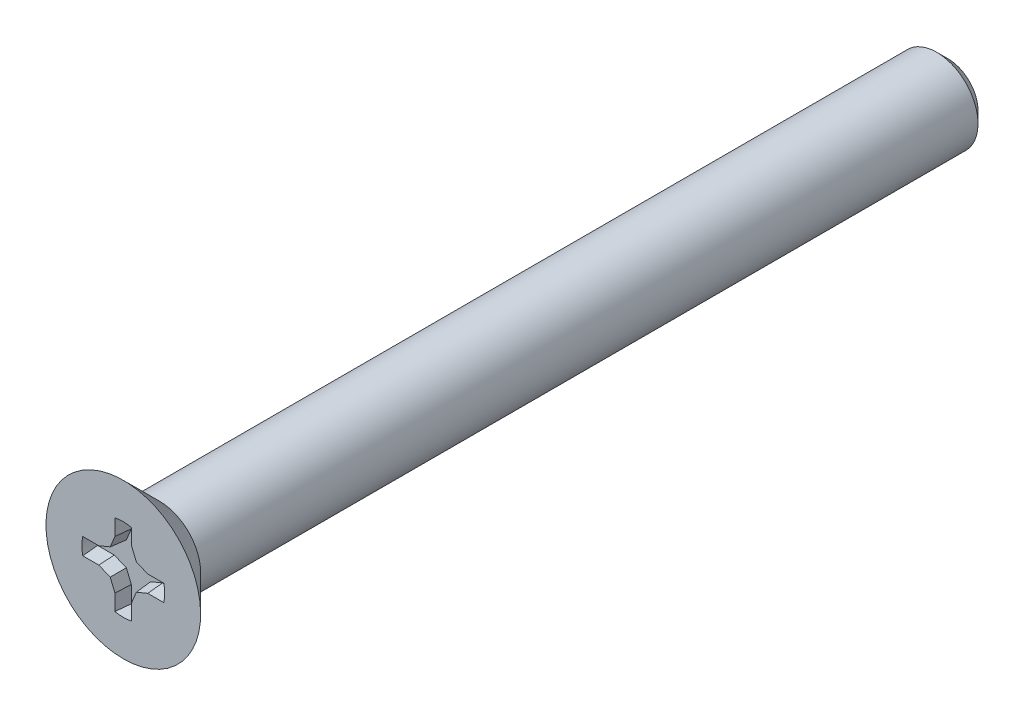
ISO-10303-21;
HEADER;
FILE_DESCRIPTION(('STEP AP214'),'2;1');
FILE_NAME('part.step','',(''),(''),'','','');
FILE_SCHEMA(('AUTOMOTIVE_DESIGN { 1 0 10303 214 1 1 1 1 }'));
ENDSEC;
DATA;
#1=APPLICATION_CONTEXT('core data for automotive mechanical design processes');
#2=APPLICATION_PROTOCOL_DEFINITION('international standard','automotive_design',2000,#1);
#3=PRODUCT_CONTEXT('',#1,'mechanical');
#4=PRODUCT('Part','Part','',(#3));
#5=PRODUCT_RELATED_PRODUCT_CATEGORY('part','',(#4));
#6=PRODUCT_DEFINITION_FORMATION('','',#4);
#7=PRODUCT_DEFINITION_CONTEXT('part definition',#1,'design');
#8=PRODUCT_DEFINITION('design','',#6,#7);
#9=PRODUCT_DEFINITION_SHAPE('','',#8);
#10=(LENGTH_UNIT() NAMED_UNIT(*) SI_UNIT(.MILLI.,.METRE.));
#11=(NAMED_UNIT(*) PLANE_ANGLE_UNIT() SI_UNIT($,.RADIAN.));
#12=(NAMED_UNIT(*) SI_UNIT($,.STERADIAN.) SOLID_ANGLE_UNIT());
#13=UNCERTAINTY_MEASURE_WITH_UNIT(LENGTH_MEASURE(1.E-05),#10,'distance_accuracy_value','');
#14=(GEOMETRIC_REPRESENTATION_CONTEXT(3) GLOBAL_UNCERTAINTY_ASSIGNED_CONTEXT((#13)) GLOBAL_UNIT_ASSIGNED_CONTEXT((#10,
#11,#12)) REPRESENTATION_CONTEXT('',''));
#15=CARTESIAN_POINT('',(0.,0.,0.));
#16=DIRECTION('',(0.,0.,1.));
#17=DIRECTION('',(1.,0.,0.));
#18=AXIS2_PLACEMENT_3D('',#15,#16,#17);
#19=CARTESIAN_POINT('',(0.,0.,2.2));
#20=DIRECTION('',(0.,0.,-1.));
#21=DIRECTION('',(0.,1.,0.));
#22=AXIS2_PLACEMENT_3D('',#19,#20,#21);
#23=PLANE('',#22);
#24=CARTESIAN_POINT('',(0.,0.,2.2));
#25=DIRECTION('',(0.,0.,1.));
#26=DIRECTION('',(0.,-1.,0.));
#27=AXIS2_PLACEMENT_3D('',#24,#25,#26);
#28=CIRCLE('',#27,3.75);
#29=CARTESIAN_POINT('',(0.,-3.75,2.2));
#30=VERTEX_POINT('',#29);
#31=EDGE_CURVE('E11',#30,#30,#28,.T.);
#32=ORIENTED_EDGE('',*,*,#31,.T.);
#33=EDGE_LOOP('',(#32));
#34=FACE_BOUND('',#33,.T.);
#35=CARTESIAN_POINT('',(0.,0.,2.2));
#36=DIRECTION('',(0.,0.,1.));
#37=DIRECTION('',(1.,0.,0.));
#38=AXIS2_PLACEMENT_3D('',#35,#36,#37);
#39=CIRCLE('',#38,2.0066);
#40=CARTESIAN_POINT('',(1.96501465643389,-0.406400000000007,2.2));
#41=VERTEX_POINT('',#40);
#42=CARTESIAN_POINT('',(1.96501465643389,0.4064,2.2));
#43=VERTEX_POINT('',#42);
#44=EDGE_CURVE('E253',#41,#43,#39,.T.);
#45=ORIENTED_EDGE('',*,*,#44,.F.);
#46=DIRECTION('',(-1.,0.,0.));
#47=VECTOR('',#46,1.);
#48=CARTESIAN_POINT('',(0.,-0.4064,2.2));
#49=LINE('',#48,#47);
#50=CARTESIAN_POINT('',(1.18570732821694,-0.406400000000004,2.2));
#51=VERTEX_POINT('',#50);
#52=EDGE_CURVE('E244',#41,#51,#49,.T.);
#53=ORIENTED_EDGE('',*,*,#52,.T.);
#54=DIRECTION('',(-0.923879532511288,-0.382683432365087,0.));
#55=VECTOR('',#54,1.);
#56=CARTESIAN_POINT('',(0.317326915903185,-0.766094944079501,2.2));
#57=LINE('',#56,#55);
#58=CARTESIAN_POINT('',(0.634653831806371,-0.634653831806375,2.2));
#59=VERTEX_POINT('',#58);
#60=EDGE_CURVE('E240',#51,#59,#57,.T.);
#61=ORIENTED_EDGE('',*,*,#60,.T.);
#62=DIRECTION('',(-0.382683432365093,-0.923879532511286,0.));
#63=VECTOR('',#62,1.);
#64=CARTESIAN_POINT('',(0.766094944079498,-0.317326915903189,2.2));
#65=LINE('',#64,#63);
#66=CARTESIAN_POINT('',(0.406399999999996,-1.18570732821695,2.2));
#67=VERTEX_POINT('',#66);
#68=EDGE_CURVE('E236',#59,#67,#65,.T.);
#69=ORIENTED_EDGE('',*,*,#68,.T.);
#70=DIRECTION('',(0.,1.,0.));
#71=VECTOR('',#70,1.);
#72=CARTESIAN_POINT('',(0.4064,0.,2.2));
#73=LINE('',#72,#71);
#74=CARTESIAN_POINT('',(0.406399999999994,-1.96501465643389,2.2));
#75=VERTEX_POINT('',#74);
#76=EDGE_CURVE('E232',#75,#67,#73,.T.);
#77=ORIENTED_EDGE('',*,*,#76,.F.);
#78=CARTESIAN_POINT('',(0.,0.,2.2));
#79=DIRECTION('',(0.,0.,1.));
#80=DIRECTION('',(0.,-1.,0.));
#81=AXIS2_PLACEMENT_3D('',#78,#79,#80);
#82=CIRCLE('',#81,2.0066);
#83=CARTESIAN_POINT('',(-0.4064,-1.96501465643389,2.2));
#84=VERTEX_POINT('',#83);
#85=EDGE_CURVE('E227',#84,#75,#82,.T.);
#86=ORIENTED_EDGE('',*,*,#85,.F.);
#87=DIRECTION('',(0.,1.,0.));
#88=VECTOR('',#87,1.);
#89=CARTESIAN_POINT('',(-0.4064,0.,2.2));
#90=LINE('',#89,#88);
#91=CARTESIAN_POINT('',(-0.4064,-1.18570732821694,2.2));
#92=VERTEX_POINT('',#91);
#93=EDGE_CURVE('E223',#84,#92,#90,.T.);
#94=ORIENTED_EDGE('',*,*,#93,.T.);
#95=DIRECTION('',(-0.382683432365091,0.923879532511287,0.));
#96=VECTOR('',#95,1.);
#97=CARTESIAN_POINT('',(-0.766094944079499,-0.317326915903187,2.2));
#98=LINE('',#97,#96);
#99=CARTESIAN_POINT('',(-0.634653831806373,-0.634653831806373,2.2));
#100=VERTEX_POINT('',#99);
#101=EDGE_CURVE('E219',#92,#100,#98,.T.);
#102=ORIENTED_EDGE('',*,*,#101,.T.);
#103=DIRECTION('',(-0.923879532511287,0.38268343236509,0.));
#104=VECTOR('',#103,1.);
#105=CARTESIAN_POINT('',(-0.317326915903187,-0.766094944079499,2.2));
#106=LINE('',#105,#104);
#107=CARTESIAN_POINT('',(-1.18570732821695,-0.4064,2.2));
#108=VERTEX_POINT('',#107);
#109=EDGE_CURVE('E215',#100,#108,#106,.T.);
#110=ORIENTED_EDGE('',*,*,#109,.T.);
#111=DIRECTION('',(1.,0.,0.));
#112=VECTOR('',#111,1.);
#113=CARTESIAN_POINT('',(0.,-0.4064,2.2));
#114=LINE('',#113,#112);
#115=CARTESIAN_POINT('',(-1.96501465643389,-0.4064,2.2));
#116=VERTEX_POINT('',#115);
#117=EDGE_CURVE('E211',#116,#108,#114,.T.);
#118=ORIENTED_EDGE('',*,*,#117,.F.);
#119=CARTESIAN_POINT('',(0.,0.,2.2));
#120=DIRECTION('',(0.,0.,1.));
#121=DIRECTION('',(-1.,0.,0.));
#122=AXIS2_PLACEMENT_3D('',#119,#120,#121);
#123=CIRCLE('',#122,2.0066);
#124=CARTESIAN_POINT('',(-1.96501465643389,0.40640000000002,2.2));
#125=VERTEX_POINT('',#124);
#126=EDGE_CURVE('E206',#125,#116,#123,.T.);
#127=ORIENTED_EDGE('',*,*,#126,.F.);
#128=DIRECTION('',(1.,0.,0.));
#129=VECTOR('',#128,1.);
#130=CARTESIAN_POINT('',(0.,0.4064,2.2));
#131=LINE('',#130,#129);
#132=CARTESIAN_POINT('',(-1.18570732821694,0.406400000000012,2.2));
#133=VERTEX_POINT('',#132);
#134=EDGE_CURVE('E202',#125,#133,#131,.T.);
#135=ORIENTED_EDGE('',*,*,#134,.T.);
#136=DIRECTION('',(0.923879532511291,0.382683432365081,0.));
#137=VECTOR('',#136,1.);
#138=CARTESIAN_POINT('',(-0.317326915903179,0.766094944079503,2.2));
#139=LINE('',#138,#137);
#140=CARTESIAN_POINT('',(-0.634653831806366,0.63465383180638,2.2));
#141=VERTEX_POINT('',#140);
#142=EDGE_CURVE('E199',#133,#141,#139,.T.);
#143=ORIENTED_EDGE('',*,*,#142,.T.);
#144=DIRECTION('',(0.3826834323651,0.923879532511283,0.));
#145=VECTOR('',#144,1.);
#146=CARTESIAN_POINT('',(-0.766094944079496,0.317326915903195,2.2));
#147=LINE('',#146,#145);
#148=CARTESIAN_POINT('',(-0.406399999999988,1.18570732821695,2.2));
#149=VERTEX_POINT('',#148);
#150=EDGE_CURVE('E192',#141,#149,#147,.T.);
#151=ORIENTED_EDGE('',*,*,#150,.T.);
#152=DIRECTION('',(0.,-1.,0.));
#153=VECTOR('',#152,1.);
#154=CARTESIAN_POINT('',(-0.4064,0.,2.2));
#155=LINE('',#154,#153);
#156=CARTESIAN_POINT('',(-0.40639999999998,1.96501465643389,2.2));
#157=VERTEX_POINT('',#156);
#158=EDGE_CURVE('E185',#157,#149,#155,.T.);
#159=ORIENTED_EDGE('',*,*,#158,.F.);
#160=CARTESIAN_POINT('',(0.,0.,2.2));
#161=DIRECTION('',(0.,0.,1.));
#162=DIRECTION('',(1.,0.,0.));
#163=AXIS2_PLACEMENT_3D('',#160,#161,#162);
#164=CIRCLE('',#163,2.0066);
#165=CARTESIAN_POINT('',(0.4064,1.96501465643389,2.2));
#166=VERTEX_POINT('',#165);
#167=EDGE_CURVE('E170',#157,#166,#164,.F.);
#168=ORIENTED_EDGE('',*,*,#167,.T.);
#169=DIRECTION('',(0.,-1.,0.));
#170=VECTOR('',#169,1.);
#171=CARTESIAN_POINT('',(0.4064,0.,2.2));
#172=LINE('',#171,#170);
#173=CARTESIAN_POINT('',(0.4064,1.18570732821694,2.2));
#174=VERTEX_POINT('',#173);
#175=EDGE_CURVE('E179',#166,#174,#172,.T.);
#176=ORIENTED_EDGE('',*,*,#175,.T.);
#177=DIRECTION('',(0.382683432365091,-0.923879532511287,0.));
#178=VECTOR('',#177,1.);
#179=CARTESIAN_POINT('',(0.766094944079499,0.317326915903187,2.2));
#180=LINE('',#179,#178);
#181=CARTESIAN_POINT('',(0.634653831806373,0.634653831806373,2.2));
#182=VERTEX_POINT('',#181);
#183=EDGE_CURVE('E262',#174,#182,#180,.T.);
#184=ORIENTED_EDGE('',*,*,#183,.T.);
#185=DIRECTION('',(0.923879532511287,-0.38268343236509,0.));
#186=VECTOR('',#185,1.);
#187=CARTESIAN_POINT('',(0.317326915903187,0.766094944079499,2.2));
#188=LINE('',#187,#186);
#189=CARTESIAN_POINT('',(1.18570732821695,0.4064,2.2));
#190=VERTEX_POINT('',#189);
#191=EDGE_CURVE('E259',#182,#190,#188,.T.);
#192=ORIENTED_EDGE('',*,*,#191,.T.);
#193=DIRECTION('',(-1.,0.,0.));
#194=VECTOR('',#193,1.);
#195=CARTESIAN_POINT('',(0.,0.4064,2.2));
#196=LINE('',#195,#194);
#197=EDGE_CURVE('E256',#43,#190,#196,.T.);
#198=ORIENTED_EDGE('',*,*,#197,.F.);
#199=EDGE_LOOP('',(#45,#53,#61,#69,#77,#86,#94,#102,#110,#118,#127,#135,#143,#151,#159,#168,
#176,#184,#192,#198));
#200=FACE_BOUND('',#199,.T.);
#201=ADVANCED_FACE('F33',(#34,#200),#23,.F.);
#202=CARTESIAN_POINT('',(0.,0.,0.450000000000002));
#203=DIRECTION('',(0.,0.,1.));
#204=DIRECTION('',(0.,-1.,0.));
#205=AXIS2_PLACEMENT_3D('',#202,#203,#204);
#206=CONICAL_SURFACE('',#205,2.,0.785398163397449);
#207=ORIENTED_EDGE('',*,*,#31,.F.);
#208=EDGE_LOOP('',(#207));
#209=FACE_BOUND('',#208,.T.);
#210=CARTESIAN_POINT('',(0.,0.,0.449999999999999));
#211=DIRECTION('',(0.,0.,-1.));
#212=DIRECTION('',(0.,1.,0.));
#213=AXIS2_PLACEMENT_3D('',#210,#211,#212);
#214=CIRCLE('',#213,2.);
#215=CARTESIAN_POINT('',(0.,2.,0.449999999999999));
#216=VERTEX_POINT('',#215);
#217=EDGE_CURVE('E42',#216,#216,#214,.T.);
#218=ORIENTED_EDGE('',*,*,#217,.F.);
#219=EDGE_LOOP('',(#218));
#220=FACE_BOUND('',#219,.T.);
#221=ADVANCED_FACE('F419',(#209,#220),#206,.T.);
#222=CARTESIAN_POINT('',(0.,1.447,-37.8));
#223=DIRECTION('',(0.,0.,-1.));
#224=DIRECTION('',(0.,1.,0.));
#225=AXIS2_PLACEMENT_3D('',#222,#223,#224);
#226=PLANE('',#225);
#227=CARTESIAN_POINT('',(0.,0.,-37.8));
#228=DIRECTION('',(0.,0.,-1.));
#229=DIRECTION('',(0.,1.,0.));
#230=AXIS2_PLACEMENT_3D('',#227,#228,#229);
#231=CIRCLE('',#230,1.447);
#232=CARTESIAN_POINT('',(0.,1.447,-37.8));
#233=VERTEX_POINT('',#232);
#234=EDGE_CURVE('E266',#233,#233,#231,.T.);
#235=ORIENTED_EDGE('',*,*,#234,.T.);
#236=EDGE_LOOP('',(#235));
#237=FACE_BOUND('',#236,.T.);
#238=ADVANCED_FACE('F425',(#237),#226,.T.);
#239=CARTESIAN_POINT('',(0.,0.,-37.8));
#240=DIRECTION('',(0.,0.,-1.));
#241=DIRECTION('',(0.,1.,0.));
#242=AXIS2_PLACEMENT_3D('',#239,#240,#241);
#243=CYLINDRICAL_SURFACE('',#242,2.);
#244=ORIENTED_EDGE('',*,*,#217,.T.);
#245=EDGE_LOOP('',(#244));
#246=FACE_BOUND('',#245,.T.);
#247=CARTESIAN_POINT('',(0.,0.,-37.247));
#248=DIRECTION('',(0.,0.,-1.));
#249=DIRECTION('',(0.,1.,0.));
#250=AXIS2_PLACEMENT_3D('',#247,#248,#249);
#251=CIRCLE('',#250,2.);
#252=CARTESIAN_POINT('',(0.,2.,-37.247));
#253=VERTEX_POINT('',#252);
#254=EDGE_CURVE('E269',#253,#253,#251,.T.);
#255=ORIENTED_EDGE('',*,*,#254,.F.);
#256=EDGE_LOOP('',(#255));
#257=FACE_BOUND('',#256,.T.);
#258=ADVANCED_FACE('F473',(#246,#257),#243,.T.);
#259=CARTESIAN_POINT('',(0.,0.,-37.8));
#260=DIRECTION('',(0.,0.,1.));
#261=DIRECTION('',(0.,-1.,0.));
#262=AXIS2_PLACEMENT_3D('',#259,#260,#261);
#263=CONICAL_SURFACE('',#262,1.447,0.78539816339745);
#264=ORIENTED_EDGE('',*,*,#254,.T.);
#265=EDGE_LOOP('',(#264));
#266=FACE_BOUND('',#265,.T.);
#267=ORIENTED_EDGE('',*,*,#234,.F.);
#268=EDGE_LOOP('',(#267));
#269=FACE_BOUND('',#268,.T.);
#270=ADVANCED_FACE('F469',(#266,#269),#263,.T.);
#271=CARTESIAN_POINT('',(0.,0.,1.46666666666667));
#272=DIRECTION('',(0.,0.,1.));
#273=DIRECTION('',(1.,0.,0.));
#274=AXIS2_PLACEMENT_3D('',#271,#272,#273);
#275=CYLINDRICAL_SURFACE('',#274,2.0066);
#276=ORIENTED_EDGE('',*,*,#167,.F.);
#277=CARTESIAN_POINT('',(0.,0.,-2.44517325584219));
#278=DIRECTION('',(0.996194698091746,0.,0.0871557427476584));
#279=DIRECTION('',(-0.0871557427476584,0.,0.996194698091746));
#280=AXIS2_PLACEMENT_3D('',#277,#278,#279);
#281=ELLIPSE('',#280,23.0231529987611,2.0066);
#282=CARTESIAN_POINT('',(-0.342241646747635,1.97719857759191,1.46666666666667));
#283=VERTEX_POINT('',#282);
#284=EDGE_CURVE('E173',#283,#157,#281,.T.);
#285=ORIENTED_EDGE('',*,*,#284,.F.);
#286=CARTESIAN_POINT('',(0.,0.,1.46666666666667));
#287=DIRECTION('',(0.,0.,1.));
#288=DIRECTION('',(1.,0.,0.));
#289=AXIS2_PLACEMENT_3D('',#286,#287,#288);
#290=CIRCLE('',#289,2.0066);
#291=CARTESIAN_POINT('',(0.342241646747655,1.9771985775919,1.46666666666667));
#292=VERTEX_POINT('',#291);
#293=EDGE_CURVE('E50',#283,#292,#290,.F.);
#294=ORIENTED_EDGE('',*,*,#293,.T.);
#295=CARTESIAN_POINT('',(0.,0.,-2.4451732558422));
#296=DIRECTION('',(-0.996194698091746,0.,0.0871557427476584));
#297=DIRECTION('',(0.0871557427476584,0.,0.996194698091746));
#298=AXIS2_PLACEMENT_3D('',#295,#296,#297);
#299=ELLIPSE('',#298,23.0231529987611,2.0066);
#300=EDGE_CURVE('E37',#292,#166,#299,.F.);
#301=ORIENTED_EDGE('',*,*,#300,.T.);
#302=EDGE_LOOP('',(#276,#285,#294,#301));
#303=FACE_BOUND('',#302,.T.);
#304=ADVANCED_FACE('F172',(#303),#275,.F.);
#305=CARTESIAN_POINT('',(0.4064,0.,2.2));
#306=DIRECTION('',(-0.996194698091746,0.,0.0871557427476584));
#307=DIRECTION('',(0.0871557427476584,0.,0.996194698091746));
#308=AXIS2_PLACEMENT_3D('',#305,#306,#307);
#309=PLANE('',#308);
#310=ORIENTED_EDGE('',*,*,#175,.F.);
#311=ORIENTED_EDGE('',*,*,#300,.F.);
#312=DIRECTION('',(0.,-1.,0.));
#313=VECTOR('',#312,1.);
#314=CARTESIAN_POINT('',(0.342241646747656,0.,1.46666666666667));
#315=LINE('',#314,#313);
#316=CARTESIAN_POINT('',(0.342241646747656,1.17294543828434,1.46666666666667));
#317=VERTEX_POINT('',#316);
#318=EDGE_CURVE('E57',#292,#317,#315,.T.);
#319=ORIENTED_EDGE('',*,*,#318,.T.);
#320=DIRECTION('',(0.0871426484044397,0.0173337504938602,0.996045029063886));
#321=VECTOR('',#320,1.);
#322=CARTESIAN_POINT('',(0.404608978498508,1.18535107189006,2.17952853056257));
#323=LINE('',#322,#321);
#324=EDGE_CURVE('E329',#317,#174,#323,.T.);
#325=ORIENTED_EDGE('',*,*,#324,.T.);
#326=EDGE_LOOP('',(#310,#311,#319,#325));
#327=FACE_BOUND('',#326,.T.);
#328=ADVANCED_FACE('F358',(#327),#309,.T.);
#329=CARTESIAN_POINT('',(0.766094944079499,0.317326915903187,2.2));
#330=DIRECTION('',(-0.920363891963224,-0.381227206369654,0.0871557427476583));
#331=DIRECTION('',(0.38268343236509,-0.923879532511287,0.));
#332=AXIS2_PLACEMENT_3D('',#329,#330,#331);
#333=PLANE('',#332);
#334=ORIENTED_EDGE('',*,*,#183,.F.);
#335=ORIENTED_EDGE('',*,*,#324,.F.);
#336=DIRECTION('',(0.38268343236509,-0.923879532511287,0.));
#337=VECTOR('',#336,1.);
#338=CARTESIAN_POINT('',(0.70682035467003,0.292774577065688,1.46666666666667));
#339=LINE('',#338,#337);
#340=CARTESIAN_POINT('',(0.585549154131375,0.585549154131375,1.46666666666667));
#341=VERTEX_POINT('',#340);
#342=EDGE_CURVE('E340',#317,#341,#339,.T.);
#343=ORIENTED_EDGE('',*,*,#342,.T.);
#344=DIRECTION('',(0.0666626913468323,0.0666626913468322,0.995546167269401));
#345=VECTOR('',#344,1.);
#346=CARTESIAN_POINT('',(0.633827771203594,0.633827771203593,2.18766354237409));
#347=LINE('',#346,#345);
#348=EDGE_CURVE('E331',#341,#182,#347,.T.);
#349=ORIENTED_EDGE('',*,*,#348,.T.);
#350=EDGE_LOOP('',(#334,#335,#343,#349));
#351=FACE_BOUND('',#350,.T.);
#352=ADVANCED_FACE('F345',(#351),#333,.T.);
#353=CARTESIAN_POINT('',(0.317326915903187,0.766094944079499,2.2));
#354=DIRECTION('',(-0.381227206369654,-0.920363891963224,0.0871557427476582));
#355=DIRECTION('',(0.923879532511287,-0.38268343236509,0.));
#356=AXIS2_PLACEMENT_3D('',#353,#354,#355);
#357=PLANE('',#356);
#358=ORIENTED_EDGE('',*,*,#191,.F.);
#359=ORIENTED_EDGE('',*,*,#348,.F.);
#360=DIRECTION('',(0.923879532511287,-0.38268343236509,0.));
#361=VECTOR('',#360,1.);
#362=CARTESIAN_POINT('',(0.292774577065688,0.706820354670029,1.46666666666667));
#363=LINE('',#362,#361);
#364=CARTESIAN_POINT('',(1.17294543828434,0.342241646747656,1.46666666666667));
#365=VERTEX_POINT('',#364);
#366=EDGE_CURVE('E338',#341,#365,#363,.T.);
#367=ORIENTED_EDGE('',*,*,#366,.T.);
#368=DIRECTION('',(-0.0173337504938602,-0.0871426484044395,-0.996045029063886));
#369=VECTOR('',#368,1.);
#370=CARTESIAN_POINT('',(1.18535107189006,0.404608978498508,2.17952853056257));
#371=LINE('',#370,#369);
#372=EDGE_CURVE('E333',#365,#190,#371,.F.);
#373=ORIENTED_EDGE('',*,*,#372,.T.);
#374=EDGE_LOOP('',(#358,#359,#367,#373));
#375=FACE_BOUND('',#374,.T.);
#376=ADVANCED_FACE('F350',(#375),#357,.T.);
#377=CARTESIAN_POINT('',(0.,0.4064,2.2));
#378=DIRECTION('',(0.,-0.996194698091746,0.0871557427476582));
#379=DIRECTION('',(0.,-0.0871557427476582,-0.996194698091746));
#380=AXIS2_PLACEMENT_3D('',#377,#378,#379);
#381=PLANE('',#380);
#382=ORIENTED_EDGE('',*,*,#197,.T.);
#383=ORIENTED_EDGE('',*,*,#372,.F.);
#384=DIRECTION('',(1.,0.,0.));
#385=VECTOR('',#384,1.);
#386=CARTESIAN_POINT('',(0.,0.342241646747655,1.46666666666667));
#387=LINE('',#386,#385);
#388=CARTESIAN_POINT('',(1.97719857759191,0.342241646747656,1.46666666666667));
#389=VERTEX_POINT('',#388);
#390=EDGE_CURVE('E250',#389,#365,#387,.F.);
#391=ORIENTED_EDGE('',*,*,#390,.F.);
#392=CARTESIAN_POINT('',(0.,0.,-2.44517325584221));
#393=DIRECTION('',(0.,-0.996194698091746,0.0871557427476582));
#394=DIRECTION('',(0.,0.0871557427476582,0.996194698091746));
#395=AXIS2_PLACEMENT_3D('',#392,#393,#394);
#396=ELLIPSE('',#395,23.0231529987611,2.0066);
#397=EDGE_CURVE('E252',#389,#43,#396,.T.);
#398=ORIENTED_EDGE('',*,*,#397,.T.);
#399=EDGE_LOOP('',(#382,#383,#391,#398));
#400=FACE_BOUND('',#399,.T.);
#401=ADVANCED_FACE('F356',(#400),#381,.T.);
#402=CARTESIAN_POINT('',(0.,0.,1.46666666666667));
#403=DIRECTION('',(0.,0.,1.));
#404=DIRECTION('',(1.,0.,0.));
#405=AXIS2_PLACEMENT_3D('',#402,#403,#404);
#406=CYLINDRICAL_SURFACE('',#405,2.0066);
#407=ORIENTED_EDGE('',*,*,#44,.T.);
#408=ORIENTED_EDGE('',*,*,#397,.F.);
#409=CARTESIAN_POINT('',(0.,0.,1.46666666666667));
#410=DIRECTION('',(0.,0.,1.));
#411=DIRECTION('',(1.,0.,0.));
#412=AXIS2_PLACEMENT_3D('',#409,#410,#411);
#413=CIRCLE('',#412,2.0066);
#414=CARTESIAN_POINT('',(1.9771985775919,-0.342241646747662,1.46666666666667));
#415=VERTEX_POINT('',#414);
#416=EDGE_CURVE('E178',#415,#389,#413,.T.);
#417=ORIENTED_EDGE('',*,*,#416,.F.);
#418=CARTESIAN_POINT('',(0.,0.,-2.44517325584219));
#419=DIRECTION('',(0.,0.996194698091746,0.0871557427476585));
#420=DIRECTION('',(0.,-0.0871557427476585,0.996194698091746));
#421=AXIS2_PLACEMENT_3D('',#418,#419,#420);
#422=ELLIPSE('',#421,23.023152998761,2.0066);
#423=EDGE_CURVE('E247',#415,#41,#422,.F.);
#424=ORIENTED_EDGE('',*,*,#423,.T.);
#425=EDGE_LOOP('',(#407,#408,#417,#424));
#426=FACE_BOUND('',#425,.T.);
#427=ADVANCED_FACE('F407',(#426),#406,.F.);
#428=CARTESIAN_POINT('',(0.,0.,1.46666666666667));
#429=DIRECTION('',(0.,0.,1.));
#430=DIRECTION('',(1.,0.,0.));
#431=AXIS2_PLACEMENT_3D('',#428,#429,#430);
#432=PLANE('',#431);
#433=DIRECTION('',(-1.,0.,0.));
#434=VECTOR('',#433,1.);
#435=CARTESIAN_POINT('',(0.,-0.342241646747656,1.46666666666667));
#436=LINE('',#435,#434);
#437=CARTESIAN_POINT('',(1.17294543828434,-0.34224164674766,1.46666666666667));
#438=VERTEX_POINT('',#437);
#439=EDGE_CURVE('E317',#415,#438,#436,.T.);
#440=ORIENTED_EDGE('',*,*,#439,.F.);
#441=ORIENTED_EDGE('',*,*,#416,.T.);
#442=ORIENTED_EDGE('',*,*,#390,.T.);
#443=ORIENTED_EDGE('',*,*,#366,.F.);
#444=ORIENTED_EDGE('',*,*,#342,.F.);
#445=ORIENTED_EDGE('',*,*,#318,.F.);
#446=ORIENTED_EDGE('',*,*,#293,.F.);
#447=DIRECTION('',(0.,1.,0.));
#448=VECTOR('',#447,1.);
#449=CARTESIAN_POINT('',(-0.342241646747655,0.,1.46666666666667));
#450=LINE('',#449,#448);
#451=CARTESIAN_POINT('',(-0.342241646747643,1.17294543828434,1.46666666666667));
#452=VERTEX_POINT('',#451);
#453=EDGE_CURVE('E187',#283,#452,#450,.F.);
#454=ORIENTED_EDGE('',*,*,#453,.T.);
#455=DIRECTION('',(0.3826834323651,0.923879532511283,0.));
#456=VECTOR('',#455,1.);
#457=CARTESIAN_POINT('',(-0.706820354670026,0.292774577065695,1.46666666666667));
#458=LINE('',#457,#456);
#459=CARTESIAN_POINT('',(-0.585549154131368,0.585549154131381,1.46666666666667));
#460=VERTEX_POINT('',#459);
#461=EDGE_CURVE('E279',#460,#452,#458,.T.);
#462=ORIENTED_EDGE('',*,*,#461,.F.);
#463=DIRECTION('',(0.923879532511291,0.382683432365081,0.));
#464=VECTOR('',#463,1.);
#465=CARTESIAN_POINT('',(-0.292774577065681,0.706820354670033,1.46666666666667));
#466=LINE('',#465,#464);
#467=CARTESIAN_POINT('',(-1.17294543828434,0.342241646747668,1.46666666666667));
#468=VERTEX_POINT('',#467);
#469=EDGE_CURVE('E282',#468,#460,#466,.T.);
#470=ORIENTED_EDGE('',*,*,#469,.F.);
#471=DIRECTION('',(1.,0.,0.));
#472=VECTOR('',#471,1.);
#473=CARTESIAN_POINT('',(0.,0.342241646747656,1.46666666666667));
#474=LINE('',#473,#472);
#475=CARTESIAN_POINT('',(-1.9771985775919,0.342241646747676,1.46666666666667));
#476=VERTEX_POINT('',#475);
#477=EDGE_CURVE('E188',#476,#468,#474,.T.);
#478=ORIENTED_EDGE('',*,*,#477,.F.);
#479=CARTESIAN_POINT('',(0.,0.,1.46666666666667));
#480=DIRECTION('',(0.,0.,1.));
#481=DIRECTION('',(-1.,0.,0.));
#482=AXIS2_PLACEMENT_3D('',#479,#480,#481);
#483=CIRCLE('',#482,2.0066);
#484=CARTESIAN_POINT('',(-1.97719857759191,-0.342241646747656,1.46666666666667));
#485=VERTEX_POINT('',#484);
#486=EDGE_CURVE('E208',#476,#485,#483,.T.);
#487=ORIENTED_EDGE('',*,*,#486,.T.);
#488=DIRECTION('',(-1.,0.,0.));
#489=VECTOR('',#488,1.);
#490=CARTESIAN_POINT('',(0.,-0.342241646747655,1.46666666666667));
#491=LINE('',#490,#489);
#492=CARTESIAN_POINT('',(-1.17294543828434,-0.342241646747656,1.46666666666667));
#493=VERTEX_POINT('',#492);
#494=EDGE_CURVE('E210',#485,#493,#491,.F.);
#495=ORIENTED_EDGE('',*,*,#494,.T.);
#496=DIRECTION('',(-0.923879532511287,0.38268343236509,0.));
#497=VECTOR('',#496,1.);
#498=CARTESIAN_POINT('',(-0.292774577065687,-0.706820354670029,1.46666666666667));
#499=LINE('',#498,#497);
#500=CARTESIAN_POINT('',(-0.585549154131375,-0.585549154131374,1.46666666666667));
#501=VERTEX_POINT('',#500);
#502=EDGE_CURVE('E299',#501,#493,#499,.T.);
#503=ORIENTED_EDGE('',*,*,#502,.F.);
#504=DIRECTION('',(-0.38268343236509,0.923879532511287,0.));
#505=VECTOR('',#504,1.);
#506=CARTESIAN_POINT('',(-0.706820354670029,-0.292774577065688,1.46666666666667));
#507=LINE('',#506,#505);
#508=CARTESIAN_POINT('',(-0.342241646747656,-1.17294543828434,1.46666666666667));
#509=VERTEX_POINT('',#508);
#510=EDGE_CURVE('E302',#509,#501,#507,.T.);
#511=ORIENTED_EDGE('',*,*,#510,.F.);
#512=DIRECTION('',(0.,1.,0.));
#513=VECTOR('',#512,1.);
#514=CARTESIAN_POINT('',(-0.342241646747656,0.,1.46666666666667));
#515=LINE('',#514,#513);
#516=CARTESIAN_POINT('',(-0.342241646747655,-1.9771985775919,1.46666666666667));
#517=VERTEX_POINT('',#516);
#518=EDGE_CURVE('E297',#517,#509,#515,.T.);
#519=ORIENTED_EDGE('',*,*,#518,.F.);
#520=CARTESIAN_POINT('',(0.,0.,1.46666666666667));
#521=DIRECTION('',(0.,0.,1.));
#522=DIRECTION('',(0.,-1.,0.));
#523=AXIS2_PLACEMENT_3D('',#520,#521,#522);
#524=CIRCLE('',#523,2.0066);
#525=CARTESIAN_POINT('',(0.342241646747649,-1.97719857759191,1.46666666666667));
#526=VERTEX_POINT('',#525);
#527=EDGE_CURVE('E229',#517,#526,#524,.T.);
#528=ORIENTED_EDGE('',*,*,#527,.T.);
#529=DIRECTION('',(0.,-1.,0.));
#530=VECTOR('',#529,1.);
#531=CARTESIAN_POINT('',(0.342241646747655,0.,1.46666666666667));
#532=LINE('',#531,#530);
#533=CARTESIAN_POINT('',(0.342241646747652,-1.17294543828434,1.46666666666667));
#534=VERTEX_POINT('',#533);
#535=EDGE_CURVE('E231',#526,#534,#532,.F.);
#536=ORIENTED_EDGE('',*,*,#535,.T.);
#537=DIRECTION('',(-0.382683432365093,-0.923879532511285,0.));
#538=VECTOR('',#537,1.);
#539=CARTESIAN_POINT('',(0.706820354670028,-0.29277457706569,1.46666666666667));
#540=LINE('',#539,#538);
#541=CARTESIAN_POINT('',(0.585549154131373,-0.585549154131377,1.46666666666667));
#542=VERTEX_POINT('',#541);
#543=EDGE_CURVE('E319',#542,#534,#540,.T.);
#544=ORIENTED_EDGE('',*,*,#543,.F.);
#545=DIRECTION('',(-0.923879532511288,-0.382683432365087,0.));
#546=VECTOR('',#545,1.);
#547=CARTESIAN_POINT('',(0.292774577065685,-0.70682035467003,1.46666666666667));
#548=LINE('',#547,#546);
#549=EDGE_CURVE('E322',#438,#542,#548,.T.);
#550=ORIENTED_EDGE('',*,*,#549,.F.);
#551=EDGE_LOOP('',(#440,#441,#442,#443,#444,#445,#446,#454,#462,#470,#478,#487,#495,#503,#511,
#519,#528,#536,#544,#550));
#552=FACE_BOUND('',#551,.T.);
#553=ADVANCED_FACE('F353',(#552),#432,.T.);
#554=CARTESIAN_POINT('',(0.,-0.4064,2.2));
#555=DIRECTION('',(0.,0.996194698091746,0.0871557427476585));
#556=DIRECTION('',(0.,-0.0871557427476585,0.996194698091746));
#557=AXIS2_PLACEMENT_3D('',#554,#555,#556);
#558=PLANE('',#557);
#559=ORIENTED_EDGE('',*,*,#52,.F.);
#560=ORIENTED_EDGE('',*,*,#423,.F.);
#561=ORIENTED_EDGE('',*,*,#439,.T.);
#562=DIRECTION('',(0.01733375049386,-0.0871426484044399,0.996045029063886));
#563=VECTOR('',#562,1.);
#564=CARTESIAN_POINT('',(1.18535107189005,-0.404608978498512,2.17952853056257));
#565=LINE('',#564,#563);
#566=EDGE_CURVE('E243',#438,#51,#565,.T.);
#567=ORIENTED_EDGE('',*,*,#566,.T.);
#568=EDGE_LOOP('',(#559,#560,#561,#567));
#569=FACE_BOUND('',#568,.T.);
#570=ADVANCED_FACE('F404',(#569),#558,.T.);
#571=CARTESIAN_POINT('',(0.317326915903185,-0.766094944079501,2.2));
#572=DIRECTION('',(-0.381227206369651,0.920363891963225,0.0871557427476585));
#573=DIRECTION('',(-0.923879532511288,-0.382683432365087,0.));
#574=AXIS2_PLACEMENT_3D('',#571,#572,#573);
#575=PLANE('',#574);
#576=ORIENTED_EDGE('',*,*,#60,.F.);
#577=ORIENTED_EDGE('',*,*,#566,.F.);
#578=ORIENTED_EDGE('',*,*,#549,.T.);
#579=DIRECTION('',(0.0666626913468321,-0.0666626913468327,0.995546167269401));
#580=VECTOR('',#579,1.);
#581=CARTESIAN_POINT('',(0.633827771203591,-0.633827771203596,2.18766354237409));
#582=LINE('',#581,#580);
#583=EDGE_CURVE('E239',#542,#59,#582,.T.);
#584=ORIENTED_EDGE('',*,*,#583,.T.);
#585=EDGE_LOOP('',(#576,#577,#578,#584));
#586=FACE_BOUND('',#585,.T.);
#587=ADVANCED_FACE('F401',(#586),#575,.T.);
#588=CARTESIAN_POINT('',(0.766094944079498,-0.317326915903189,2.2));
#589=DIRECTION('',(-0.920363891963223,0.381227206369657,0.0871557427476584));
#590=DIRECTION('',(-0.382683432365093,-0.923879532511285,0.));
#591=AXIS2_PLACEMENT_3D('',#588,#589,#590);
#592=PLANE('',#591);
#593=ORIENTED_EDGE('',*,*,#68,.F.);
#594=ORIENTED_EDGE('',*,*,#583,.F.);
#595=ORIENTED_EDGE('',*,*,#543,.T.);
#596=DIRECTION('',(-0.0871426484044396,0.0173337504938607,-0.996045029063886));
#597=VECTOR('',#596,1.);
#598=CARTESIAN_POINT('',(0.404608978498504,-1.18535107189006,2.17952853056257));
#599=LINE('',#598,#597);
#600=EDGE_CURVE('E234',#534,#67,#599,.F.);
#601=ORIENTED_EDGE('',*,*,#600,.T.);
#602=EDGE_LOOP('',(#593,#594,#595,#601));
#603=FACE_BOUND('',#602,.T.);
#604=ADVANCED_FACE('F397',(#603),#592,.T.);
#605=CARTESIAN_POINT('',(0.4064,0.,2.2));
#606=DIRECTION('',(-0.996194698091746,0.,0.0871557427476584));
#607=DIRECTION('',(0.0871557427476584,0.,0.996194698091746));
#608=AXIS2_PLACEMENT_3D('',#605,#606,#607);
#609=PLANE('',#608);
#610=ORIENTED_EDGE('',*,*,#76,.T.);
#611=ORIENTED_EDGE('',*,*,#600,.F.);
#612=ORIENTED_EDGE('',*,*,#535,.F.);
#613=CARTESIAN_POINT('',(0.,0.,-2.4451732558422));
#614=DIRECTION('',(-0.996194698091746,0.,0.0871557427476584));
#615=DIRECTION('',(0.0871557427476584,0.,0.996194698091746));
#616=AXIS2_PLACEMENT_3D('',#613,#614,#615);
#617=ELLIPSE('',#616,23.0231529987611,2.0066);
#618=EDGE_CURVE('E235',#526,#75,#617,.T.);
#619=ORIENTED_EDGE('',*,*,#618,.T.);
#620=EDGE_LOOP('',(#610,#611,#612,#619));
#621=FACE_BOUND('',#620,.T.);
#622=ADVANCED_FACE('F393',(#621),#609,.T.);
#623=CARTESIAN_POINT('',(0.,0.,1.46666666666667));
#624=DIRECTION('',(0.,0.,1.));
#625=DIRECTION('',(0.,-1.,0.));
#626=AXIS2_PLACEMENT_3D('',#623,#624,#625);
#627=CYLINDRICAL_SURFACE('',#626,2.0066);
#628=ORIENTED_EDGE('',*,*,#85,.T.);
#629=ORIENTED_EDGE('',*,*,#618,.F.);
#630=ORIENTED_EDGE('',*,*,#527,.F.);
#631=CARTESIAN_POINT('',(0.,0.,-2.4451732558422));
#632=DIRECTION('',(0.996194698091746,0.,0.0871557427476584));
#633=DIRECTION('',(-0.0871557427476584,0.,0.996194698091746));
#634=AXIS2_PLACEMENT_3D('',#631,#632,#633);
#635=ELLIPSE('',#634,23.0231529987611,2.0066);
#636=EDGE_CURVE('E226',#517,#84,#635,.F.);
#637=ORIENTED_EDGE('',*,*,#636,.T.);
#638=EDGE_LOOP('',(#628,#629,#630,#637));
#639=FACE_BOUND('',#638,.T.);
#640=ADVANCED_FACE('F395',(#639),#627,.F.);
#641=CARTESIAN_POINT('',(-0.4064,0.,2.2));
#642=DIRECTION('',(0.996194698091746,0.,0.0871557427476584));
#643=DIRECTION('',(0.0871557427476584,0.,-0.996194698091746));
#644=AXIS2_PLACEMENT_3D('',#641,#642,#643);
#645=PLANE('',#644);
#646=ORIENTED_EDGE('',*,*,#93,.F.);
#647=ORIENTED_EDGE('',*,*,#636,.F.);
#648=ORIENTED_EDGE('',*,*,#518,.T.);
#649=DIRECTION('',(-0.0871426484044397,-0.0173337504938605,0.996045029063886));
#650=VECTOR('',#649,1.);
#651=CARTESIAN_POINT('',(-0.404608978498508,-1.18535107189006,2.17952853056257));
#652=LINE('',#651,#650);
#653=EDGE_CURVE('E222',#509,#92,#652,.T.);
#654=ORIENTED_EDGE('',*,*,#653,.T.);
#655=EDGE_LOOP('',(#646,#647,#648,#654));
#656=FACE_BOUND('',#655,.T.);
#657=ADVANCED_FACE('F385',(#656),#645,.T.);
#658=CARTESIAN_POINT('',(-0.766094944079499,-0.317326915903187,2.2));
#659=DIRECTION('',(0.920363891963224,0.381227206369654,0.0871557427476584));
#660=DIRECTION('',(-0.38268343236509,0.923879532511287,0.));
#661=AXIS2_PLACEMENT_3D('',#658,#659,#660);
#662=PLANE('',#661);
#663=ORIENTED_EDGE('',*,*,#101,.F.);
#664=ORIENTED_EDGE('',*,*,#653,.F.);
#665=ORIENTED_EDGE('',*,*,#510,.T.);
#666=DIRECTION('',(-0.0666626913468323,-0.0666626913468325,0.995546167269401));
#667=VECTOR('',#666,1.);
#668=CARTESIAN_POINT('',(-0.633827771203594,-0.633827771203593,2.18766354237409));
#669=LINE('',#668,#667);
#670=EDGE_CURVE('E218',#501,#100,#669,.T.);
#671=ORIENTED_EDGE('',*,*,#670,.T.);
#672=EDGE_LOOP('',(#663,#664,#665,#671));
#673=FACE_BOUND('',#672,.T.);
#674=ADVANCED_FACE('F383',(#673),#662,.T.);
#675=CARTESIAN_POINT('',(-0.317326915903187,-0.766094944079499,2.2));
#676=DIRECTION('',(0.381227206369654,0.920363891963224,0.0871557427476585));
#677=DIRECTION('',(-0.923879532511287,0.38268343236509,0.));
#678=AXIS2_PLACEMENT_3D('',#675,#676,#677);
#679=PLANE('',#678);
#680=ORIENTED_EDGE('',*,*,#109,.F.);
#681=ORIENTED_EDGE('',*,*,#670,.F.);
#682=ORIENTED_EDGE('',*,*,#502,.T.);
#683=DIRECTION('',(0.0173337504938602,0.0871426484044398,-0.996045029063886));
#684=VECTOR('',#683,1.);
#685=CARTESIAN_POINT('',(-1.18535107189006,-0.404608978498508,2.17952853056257));
#686=LINE('',#685,#684);
#687=EDGE_CURVE('E213',#493,#108,#686,.F.);
#688=ORIENTED_EDGE('',*,*,#687,.T.);
#689=EDGE_LOOP('',(#680,#681,#682,#688));
#690=FACE_BOUND('',#689,.T.);
#691=ADVANCED_FACE('F378',(#690),#679,.T.);
#692=CARTESIAN_POINT('',(0.,-0.4064,2.2));
#693=DIRECTION('',(0.,0.996194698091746,0.0871557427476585));
#694=DIRECTION('',(0.,-0.0871557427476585,0.996194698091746));
#695=AXIS2_PLACEMENT_3D('',#692,#693,#694);
#696=PLANE('',#695);
#697=ORIENTED_EDGE('',*,*,#117,.T.);
#698=ORIENTED_EDGE('',*,*,#687,.F.);
#699=ORIENTED_EDGE('',*,*,#494,.F.);
#700=CARTESIAN_POINT('',(0.,0.,-2.44517325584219));
#701=DIRECTION('',(0.,0.996194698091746,0.0871557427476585));
#702=DIRECTION('',(0.,-0.0871557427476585,0.996194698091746));
#703=AXIS2_PLACEMENT_3D('',#700,#701,#702);
#704=ELLIPSE('',#703,23.023152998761,2.0066);
#705=EDGE_CURVE('E214',#485,#116,#704,.T.);
#706=ORIENTED_EDGE('',*,*,#705,.T.);
#707=EDGE_LOOP('',(#697,#698,#699,#706));
#708=FACE_BOUND('',#707,.T.);
#709=ADVANCED_FACE('F35',(#708),#696,.T.);
#710=CARTESIAN_POINT('',(0.,0.,1.46666666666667));
#711=DIRECTION('',(0.,0.,1.));
#712=DIRECTION('',(-1.,0.,0.));
#713=AXIS2_PLACEMENT_3D('',#710,#711,#712);
#714=CYLINDRICAL_SURFACE('',#713,2.0066);
#715=ORIENTED_EDGE('',*,*,#126,.T.);
#716=ORIENTED_EDGE('',*,*,#705,.F.);
#717=ORIENTED_EDGE('',*,*,#486,.F.);
#718=CARTESIAN_POINT('',(0.,0.,-2.44517325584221));
#719=DIRECTION('',(0.,-0.996194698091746,0.0871557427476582));
#720=DIRECTION('',(0.,0.0871557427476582,0.996194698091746));
#721=AXIS2_PLACEMENT_3D('',#718,#719,#720);
#722=ELLIPSE('',#721,23.0231529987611,2.0066);
#723=EDGE_CURVE('E205',#476,#125,#722,.F.);
#724=ORIENTED_EDGE('',*,*,#723,.T.);
#725=EDGE_LOOP('',(#715,#716,#717,#724));
#726=FACE_BOUND('',#725,.T.);
#727=ADVANCED_FACE('F371',(#726),#714,.F.);
#728=CARTESIAN_POINT('',(0.,0.4064,2.2));
#729=DIRECTION('',(0.,-0.996194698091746,0.0871557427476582));
#730=DIRECTION('',(0.,-0.0871557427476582,-0.996194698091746));
#731=AXIS2_PLACEMENT_3D('',#728,#729,#730);
#732=PLANE('',#731);
#733=ORIENTED_EDGE('',*,*,#134,.F.);
#734=ORIENTED_EDGE('',*,*,#723,.F.);
#735=ORIENTED_EDGE('',*,*,#477,.T.);
#736=DIRECTION('',(-0.0173337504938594,0.0871426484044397,0.996045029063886));
#737=VECTOR('',#736,1.);
#738=CARTESIAN_POINT('',(-1.18535107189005,0.40460897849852,2.17952853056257));
#739=LINE('',#738,#737);
#740=EDGE_CURVE('E201',#468,#133,#739,.T.);
#741=ORIENTED_EDGE('',*,*,#740,.T.);
#742=EDGE_LOOP('',(#733,#734,#735,#741));
#743=FACE_BOUND('',#742,.T.);
#744=ADVANCED_FACE('F369',(#743),#732,.T.);
#745=CARTESIAN_POINT('',(-0.317326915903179,0.766094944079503,2.2));
#746=DIRECTION('',(0.381227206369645,-0.920363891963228,0.0871557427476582));
#747=DIRECTION('',(0.923879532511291,0.382683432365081,0.));
#748=AXIS2_PLACEMENT_3D('',#745,#746,#747);
#749=PLANE('',#748);
#750=ORIENTED_EDGE('',*,*,#142,.F.);
#751=ORIENTED_EDGE('',*,*,#740,.F.);
#752=ORIENTED_EDGE('',*,*,#469,.T.);
#753=DIRECTION('',(-0.0666626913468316,0.0666626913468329,0.995546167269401));
#754=VECTOR('',#753,1.);
#755=CARTESIAN_POINT('',(-0.633827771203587,0.6338277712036,2.18766354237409));
#756=LINE('',#755,#754);
#757=EDGE_CURVE('E198',#460,#141,#756,.T.);
#758=ORIENTED_EDGE('',*,*,#757,.T.);
#759=EDGE_LOOP('',(#750,#751,#752,#758));
#760=FACE_BOUND('',#759,.T.);
#761=ADVANCED_FACE('F363',(#760),#749,.T.);
#762=CARTESIAN_POINT('',(-0.766094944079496,0.317326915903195,2.2));
#763=DIRECTION('',(0.92036389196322,-0.381227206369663,0.0871557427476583));
#764=DIRECTION('',(0.3826834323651,0.923879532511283,0.));
#765=AXIS2_PLACEMENT_3D('',#762,#763,#764);
#766=PLANE('',#765);
#767=ORIENTED_EDGE('',*,*,#150,.F.);
#768=ORIENTED_EDGE('',*,*,#757,.F.);
#769=ORIENTED_EDGE('',*,*,#461,.T.);
#770=DIRECTION('',(0.0871426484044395,-0.017333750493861,-0.996045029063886));
#771=VECTOR('',#770,1.);
#772=CARTESIAN_POINT('',(-0.404608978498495,1.18535107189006,2.17952853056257));
#773=LINE('',#772,#771);
#774=EDGE_CURVE('E193',#452,#149,#773,.F.);
#775=ORIENTED_EDGE('',*,*,#774,.T.);
#776=EDGE_LOOP('',(#767,#768,#769,#775));
#777=FACE_BOUND('',#776,.T.);
#778=ADVANCED_FACE('F361',(#777),#766,.T.);
#779=CARTESIAN_POINT('',(-0.4064,0.,2.2));
#780=DIRECTION('',(0.996194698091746,0.,0.0871557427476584));
#781=DIRECTION('',(0.0871557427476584,0.,-0.996194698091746));
#782=AXIS2_PLACEMENT_3D('',#779,#780,#781);
#783=PLANE('',#782);
#784=ORIENTED_EDGE('',*,*,#158,.T.);
#785=ORIENTED_EDGE('',*,*,#774,.F.);
#786=ORIENTED_EDGE('',*,*,#453,.F.);
#787=ORIENTED_EDGE('',*,*,#284,.T.);
#788=EDGE_LOOP('',(#784,#785,#786,#787));
#789=FACE_BOUND('',#788,.T.);
#790=ADVANCED_FACE('F183',(#789),#783,.T.);
#791=CLOSED_SHELL('',(#201,#221,#238,#258,#270,#304,#328,#352,#376,#401,#427,#553,#570,#587,
#604,#622,#640,#657,#674,#691,#709,#727,#744,#761,#778,#790));
#792=MANIFOLD_SOLID_BREP('B2',#791);
#793=ADVANCED_BREP_SHAPE_REPRESENTATION('',(#18,#792),#14);
#794=SHAPE_DEFINITION_REPRESENTATION(#9,#793);
ENDSEC;
END-ISO-10303-21;
